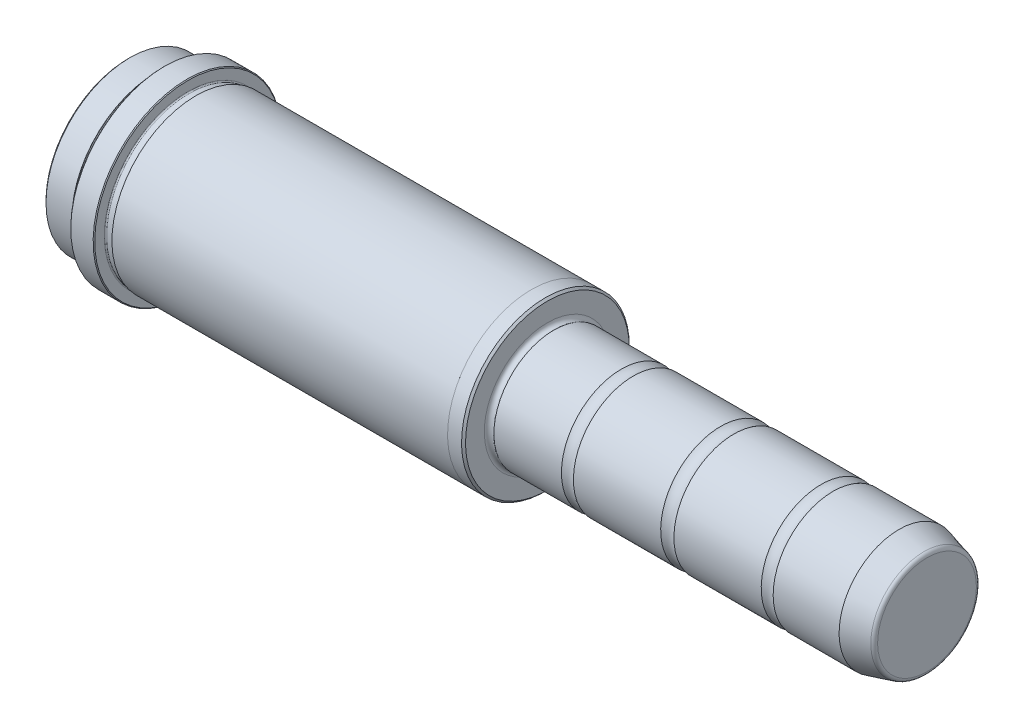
from build123d import *

# Parameters (mm, degrees)
FILLET1_R     = 1
CHAMFER1_SIZE = 0.2
CHAMFER2_SIZE = 0.5


with BuildPart() as part:
    # Sketch1 → Revolve1 (revolve)
    with BuildSketch(Plane.XY):
        with BuildLine():
            Line((95, 13.124355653), (88, 15))
            Line((88, 15), (1.6, 15))
            ThreePointArc((1.6, 15), (0.552786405, 14.905572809), (0, 15.8))
            Line((0, 15.8), (0, 21))
            Line((0, 21), (-4, 21))
            Line((-4, 21), (-88, 21.0001))
            Line((-88, 21.0001), (-88, 20.9))
            ThreePointArc((-88, 20.9), (-88.087867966, 20.687867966), (-88.3, 20.6))
            Line((-88.3, 20.6), (-89.7, 20.6))
            ThreePointArc((-89.7, 20.6), (-89.912132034, 20.687867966), (-90, 20.9))
            Line((-90, 20.9), (-90, 23.5))
            Line((-90, 23.5), (-96, 23.5))
            Line((-96, 23.5), (-96, 20.9))
            ThreePointArc((-96, 20.9), (-96.087867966, 20.687867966), (-96.3, 20.6))
            Line((-96.3, 20.6), (-97.7, 20.6))
            ThreePointArc((-97.7, 20.6), (-97.912132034, 20.687867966), (-98, 20.9))
            Line((-98, 20.9), (-98, 21))
            Line((-98, 21), (-105, 21))
            Line((-105, 21), (-105, 0))
            Line((-105, 0), (95, 0))
            Line((95, 0), (95, 13.124355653))
        make_face()
    revolve(axis=Axis((95, 0, 0), (-1, 0, 0)))

    # Sketch2 → Groove A (revolve, cut)
    with BuildSketch(Plane.XY):
        with BuildLine():
            Line((68.503337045, 15), (71.496662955, 15))
            ThreePointArc((71.496662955, 15), (70, 14.6), (68.503337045, 15))
        make_face()
    revolve(axis=Axis((95, 0, 0), (1, 0, 0)), mode=Mode.SUBTRACT)

    # Sketch3 → Groove B (revolve, cut)
    with BuildSketch(Plane.XY, mode=Mode.PRIVATE) as groove_b_sk:
        with BuildLine():
            Line((43.341687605, 15), (46.658312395, 15))
            ThreePointArc((46.658312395, 15), (45, 14.5), (43.341687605, 15))
        make_face()
    revolve(groove_b_sk.sketch.rotate(Axis((95, 0, 0), (1, 0, 0)), 180), axis=Axis((95, 0, 0), (1, 0, 0)), mode=Mode.SUBTRACT)

    # Sketch4 → Groove C (revolve, cut)
    with BuildSketch(Plane.XY, mode=Mode.PRIVATE) as groove_c_sk:
        with BuildLine():
            Line((18.503337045, 15), (21.496662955, 15))
            ThreePointArc((21.496662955, 15), (20, 14.6), (18.503337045, 15))
        make_face()
    revolve(groove_c_sk.sketch.rotate(Axis((95, 0, 0), (1, 0, 0)), 180), axis=Axis((95, 0, 0), (1, 0, 0)), mode=Mode.SUBTRACT)

    # Fillet1
    fillet1_edges = [part.edges().sort_by_distance(p)[0] for p in [
        (95, -13.124355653, 0),
    ]]
    fillet(fillet1_edges, radius=FILLET1_R)

    # Chamfer1
    chamfer1_edges = [part.edges().sort_by_distance(p)[0] for p in [
        (-90, -23.5, 0),
        (-96, -23.5, 0),
    ]]
    chamfer(chamfer1_edges, length=CHAMFER1_SIZE)

    # Chamfer2
    chamfer2_edges = [part.edges().sort_by_distance(p)[0] for p in [
        (0, -21, 0),
        (-105, -21, 0),
    ]]
    chamfer(chamfer2_edges, length=CHAMFER2_SIZE)


solid = part.part
